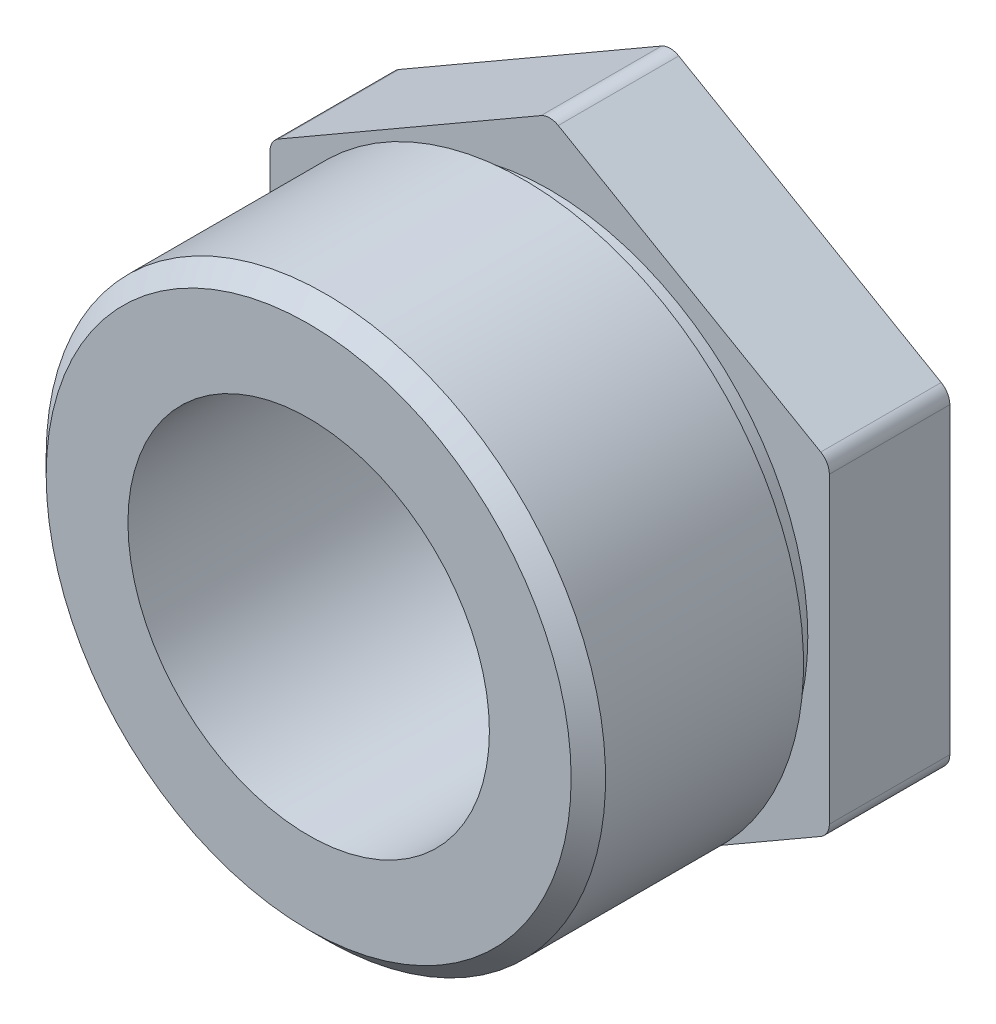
from build123d import *

# Parameters (mm, degrees)
SKETCH1_R           = 32.5
BOSS_EXTRUDE1_DEPTH = 42
CUT_EXTRUDE1_START  = -28
SKETCH2_R           = 32.5
SKETCH2_R_2         = 30
CUT_EXTRUDE1_DEPTH  = 3
BOSS_EXTRUDE3_DEPTH = 14
FILLET1_R           = 2
CHAMFER1_SIZE       = 2
CUT_EXTRUDE2_START  = -42
SKETCH6_R           = 21
CUT_EXTRUDE2_DEPTH  = 42


with BuildPart() as part:
    # Sketch1 → Boss-Extrude1 (new body)
    with BuildSketch(Plane.XY):
        with Locations(Location((0, 0, 0), (0, 0, 180))):
            Circle(SKETCH1_R)
    extrude(amount=BOSS_EXTRUDE1_DEPTH)

    # Sketch2 → Cut-Extrude1 (cut)
    with BuildSketch(Plane.XY.offset(42).offset(CUT_EXTRUDE1_START)):
        with Locations(Location((0, 0, 0), (0, 0, 180))):
            Circle(SKETCH2_R)
        Circle(SKETCH2_R_2, mode=Mode.SUBTRACT)
    extrude(amount=CUT_EXTRUDE1_DEPTH, mode=Mode.SUBTRACT)

    # Sketch4 → Boss-Extrude3 (add)
    with BuildSketch(Plane(origin=(0, 0, 0), x_dir=(-1, 0, 0), z_dir=(0, 0, -1))):
        Polygon((32.5, 18.763883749), (0, 37.527767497), (-32.5, 18.763883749), (-32.5, -18.763883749), (0, -37.527767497), (32.5, -18.763883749), align=None)
    extrude(amount=-BOSS_EXTRUDE3_DEPTH)

    # Fillet1
    fillet1_edges = [part.edges().sort_by_distance(p)[0] for p in [
        (-32.5, 18.763883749, 7),
        (-32.5, -18.763883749, 7),
        (0, -37.527767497, 7),
        (32.5, -18.763883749, 7),
        (32.5, 18.763883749, 7),
        (0, 37.527767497, 7),
    ]]
    fillet(fillet1_edges, radius=FILLET1_R)

    # Chamfer1
    chamfer1_edges = [part.edges().sort_by_distance(p)[0] for p in [
        (32.5, 0, 42),
    ]]
    chamfer(chamfer1_edges, length=CHAMFER1_SIZE)

    # Sketch6 → Cut-Extrude2 (cut)
    with BuildSketch(Plane.XY.offset(42).offset(CUT_EXTRUDE2_START)):
        Circle(SKETCH6_R)
    extrude(amount=CUT_EXTRUDE2_DEPTH, mode=Mode.SUBTRACT)


solid = part.part
